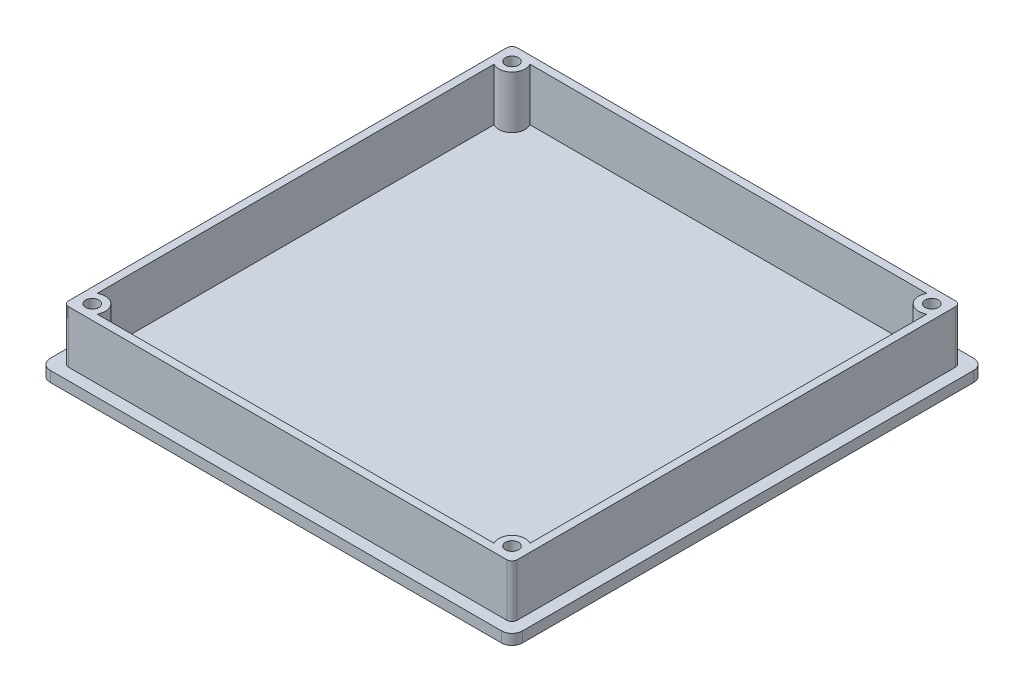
ISO-10303-21;
HEADER;
FILE_DESCRIPTION(('STEP AP214'),'2;1');
FILE_NAME('part.step','',(''),(''),'','','');
FILE_SCHEMA(('AUTOMOTIVE_DESIGN { 1 0 10303 214 1 1 1 1 }'));
ENDSEC;
DATA;
#1=APPLICATION_CONTEXT('core data for automotive mechanical design processes');
#2=APPLICATION_PROTOCOL_DEFINITION('international standard','automotive_design',2000,#1);
#3=PRODUCT_CONTEXT('',#1,'mechanical');
#4=PRODUCT('Part','Part','',(#3));
#5=PRODUCT_RELATED_PRODUCT_CATEGORY('part','',(#4));
#6=PRODUCT_DEFINITION_FORMATION('','',#4);
#7=PRODUCT_DEFINITION_CONTEXT('part definition',#1,'design');
#8=PRODUCT_DEFINITION('design','',#6,#7);
#9=PRODUCT_DEFINITION_SHAPE('','',#8);
#10=(LENGTH_UNIT() NAMED_UNIT(*) SI_UNIT(.MILLI.,.METRE.));
#11=(NAMED_UNIT(*) PLANE_ANGLE_UNIT() SI_UNIT($,.RADIAN.));
#12=(NAMED_UNIT(*) SI_UNIT($,.STERADIAN.) SOLID_ANGLE_UNIT());
#13=UNCERTAINTY_MEASURE_WITH_UNIT(LENGTH_MEASURE(1.E-05),#10,'distance_accuracy_value','');
#14=(GEOMETRIC_REPRESENTATION_CONTEXT(3) GLOBAL_UNCERTAINTY_ASSIGNED_CONTEXT((#13)) GLOBAL_UNIT_ASSIGNED_CONTEXT((#10,
#11,#12)) REPRESENTATION_CONTEXT('',''));
#15=CARTESIAN_POINT('',(0.,0.,0.));
#16=DIRECTION('',(0.,0.,1.));
#17=DIRECTION('',(1.,0.,0.));
#18=AXIS2_PLACEMENT_3D('',#15,#16,#17);
#19=CARTESIAN_POINT('',(-82.5,24.,82.5));
#20=DIRECTION('',(0.,0.,-1.));
#21=DIRECTION('',(-1.,0.,0.));
#22=AXIS2_PLACEMENT_3D('',#19,#20,#21);
#23=PLANE('',#22);
#24=DIRECTION('',(1.,0.,0.));
#25=VECTOR('',#24,1.);
#26=CARTESIAN_POINT('',(-82.5,24.,82.5));
#27=LINE('',#26,#25);
#28=CARTESIAN_POINT('',(-75.6698729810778,24.,82.5));
#29=VERTEX_POINT('',#28);
#30=CARTESIAN_POINT('',(75.6698729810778,24.,82.5));
#31=VERTEX_POINT('',#30);
#32=EDGE_CURVE('E224',#29,#31,#27,.T.);
#33=ORIENTED_EDGE('',*,*,#32,.T.);
#34=DIRECTION('',(0.,-1.,0.));
#35=VECTOR('',#34,1.);
#36=CARTESIAN_POINT('',(75.6698729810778,38.142135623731,82.5));
#37=LINE('',#36,#35);
#38=CARTESIAN_POINT('',(75.6698729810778,4.,82.5));
#39=VERTEX_POINT('',#38);
#40=EDGE_CURVE('E203',#31,#39,#37,.T.);
#41=ORIENTED_EDGE('',*,*,#40,.T.);
#42=DIRECTION('',(1.,0.,0.));
#43=VECTOR('',#42,1.);
#44=CARTESIAN_POINT('',(-82.5,4.,82.5));
#45=LINE('',#44,#43);
#46=CARTESIAN_POINT('',(-75.6698729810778,4.,82.5));
#47=VERTEX_POINT('',#46);
#48=EDGE_CURVE('E239',#47,#39,#45,.T.);
#49=ORIENTED_EDGE('',*,*,#48,.F.);
#50=DIRECTION('',(0.,-1.,0.));
#51=VECTOR('',#50,1.);
#52=CARTESIAN_POINT('',(-75.6698729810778,38.142135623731,82.5));
#53=LINE('',#52,#51);
#54=EDGE_CURVE('E788',#47,#29,#53,.F.);
#55=ORIENTED_EDGE('',*,*,#54,.T.);
#56=EDGE_LOOP('',(#33,#41,#49,#55));
#57=FACE_BOUND('',#56,.T.);
#58=ADVANCED_FACE('F36',(#57),#23,.T.);
#59=CARTESIAN_POINT('',(82.5,24.,82.5));
#60=DIRECTION('',(-1.,0.,0.));
#61=DIRECTION('',(0.,0.,1.));
#62=AXIS2_PLACEMENT_3D('',#59,#60,#61);
#63=PLANE('',#62);
#64=DIRECTION('',(0.,0.,-1.));
#65=VECTOR('',#64,1.);
#66=CARTESIAN_POINT('',(82.5,4.,82.5));
#67=LINE('',#66,#65);
#68=CARTESIAN_POINT('',(82.5,4.,75.6698729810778));
#69=VERTEX_POINT('',#68);
#70=CARTESIAN_POINT('',(82.5,4.,-75.6698729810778));
#71=VERTEX_POINT('',#70);
#72=EDGE_CURVE('E216',#69,#71,#67,.T.);
#73=ORIENTED_EDGE('',*,*,#72,.F.);
#74=DIRECTION('',(0.,-1.,0.));
#75=VECTOR('',#74,1.);
#76=CARTESIAN_POINT('',(82.5,38.142135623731,75.6698729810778));
#77=LINE('',#76,#75);
#78=CARTESIAN_POINT('',(82.5,24.,75.6698729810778));
#79=VERTEX_POINT('',#78);
#80=EDGE_CURVE('E200',#69,#79,#77,.F.);
#81=ORIENTED_EDGE('',*,*,#80,.T.);
#82=DIRECTION('',(0.,0.,-1.));
#83=VECTOR('',#82,1.);
#84=CARTESIAN_POINT('',(82.5,24.,82.5));
#85=LINE('',#84,#83);
#86=CARTESIAN_POINT('',(82.5,24.,-75.6698729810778));
#87=VERTEX_POINT('',#86);
#88=EDGE_CURVE('E214',#79,#87,#85,.T.);
#89=ORIENTED_EDGE('',*,*,#88,.T.);
#90=DIRECTION('',(0.,-1.,0.));
#91=VECTOR('',#90,1.);
#92=CARTESIAN_POINT('',(82.5,38.142135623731,-75.6698729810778));
#93=LINE('',#92,#91);
#94=EDGE_CURVE('E783',#87,#71,#93,.T.);
#95=ORIENTED_EDGE('',*,*,#94,.T.);
#96=EDGE_LOOP('',(#73,#81,#89,#95));
#97=FACE_BOUND('',#96,.T.);
#98=ADVANCED_FACE('F212',(#97),#63,.T.);
#99=CARTESIAN_POINT('',(-82.5,24.,-82.5));
#100=DIRECTION('',(1.,0.,0.));
#101=DIRECTION('',(0.,0.,-1.));
#102=AXIS2_PLACEMENT_3D('',#99,#100,#101);
#103=PLANE('',#102);
#104=DIRECTION('',(0.,0.,1.));
#105=VECTOR('',#104,1.);
#106=CARTESIAN_POINT('',(-82.5,24.,-82.5));
#107=LINE('',#106,#105);
#108=CARTESIAN_POINT('',(-82.5,24.,-75.6698729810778));
#109=VERTEX_POINT('',#108);
#110=CARTESIAN_POINT('',(-82.5,24.,75.6698729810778));
#111=VERTEX_POINT('',#110);
#112=EDGE_CURVE('E229',#109,#111,#107,.T.);
#113=ORIENTED_EDGE('',*,*,#112,.T.);
#114=DIRECTION('',(0.,-1.,0.));
#115=VECTOR('',#114,1.);
#116=CARTESIAN_POINT('',(-82.5,38.142135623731,75.6698729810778));
#117=LINE('',#116,#115);
#118=CARTESIAN_POINT('',(-82.5,4.,75.6698729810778));
#119=VERTEX_POINT('',#118);
#120=EDGE_CURVE('E780',#111,#119,#117,.T.);
#121=ORIENTED_EDGE('',*,*,#120,.T.);
#122=DIRECTION('',(0.,0.,1.));
#123=VECTOR('',#122,1.);
#124=CARTESIAN_POINT('',(-82.5,4.,-82.5));
#125=LINE('',#124,#123);
#126=CARTESIAN_POINT('',(-82.5,4.,-75.6698729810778));
#127=VERTEX_POINT('',#126);
#128=EDGE_CURVE('E235',#127,#119,#125,.T.);
#129=ORIENTED_EDGE('',*,*,#128,.F.);
#130=DIRECTION('',(0.,-1.,0.));
#131=VECTOR('',#130,1.);
#132=CARTESIAN_POINT('',(-82.5,38.142135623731,-75.6698729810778));
#133=LINE('',#132,#131);
#134=EDGE_CURVE('E765',#127,#109,#133,.F.);
#135=ORIENTED_EDGE('',*,*,#134,.T.);
#136=EDGE_LOOP('',(#113,#121,#129,#135));
#137=FACE_BOUND('',#136,.T.);
#138=ADVANCED_FACE('F430',(#137),#103,.T.);
#139=CARTESIAN_POINT('',(82.5,24.,-82.5));
#140=DIRECTION('',(0.,0.,1.));
#141=DIRECTION('',(1.,0.,0.));
#142=AXIS2_PLACEMENT_3D('',#139,#140,#141);
#143=PLANE('',#142);
#144=DIRECTION('',(-1.,0.,0.));
#145=VECTOR('',#144,1.);
#146=CARTESIAN_POINT('',(82.5,4.,-82.5));
#147=LINE('',#146,#145);
#148=CARTESIAN_POINT('',(75.6698729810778,4.,-82.5));
#149=VERTEX_POINT('',#148);
#150=CARTESIAN_POINT('',(-75.6698729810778,4.,-82.5));
#151=VERTEX_POINT('',#150);
#152=EDGE_CURVE('E233',#149,#151,#147,.T.);
#153=ORIENTED_EDGE('',*,*,#152,.F.);
#154=DIRECTION('',(0.,-1.,0.));
#155=VECTOR('',#154,1.);
#156=CARTESIAN_POINT('',(75.6698729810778,38.142135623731,-82.5));
#157=LINE('',#156,#155);
#158=CARTESIAN_POINT('',(75.6698729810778,24.,-82.5));
#159=VERTEX_POINT('',#158);
#160=EDGE_CURVE('E774',#149,#159,#157,.F.);
#161=ORIENTED_EDGE('',*,*,#160,.T.);
#162=DIRECTION('',(-1.,0.,0.));
#163=VECTOR('',#162,1.);
#164=CARTESIAN_POINT('',(82.5,24.,-82.5));
#165=LINE('',#164,#163);
#166=CARTESIAN_POINT('',(-75.6698729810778,24.,-82.5));
#167=VERTEX_POINT('',#166);
#168=EDGE_CURVE('E243',#159,#167,#165,.T.);
#169=ORIENTED_EDGE('',*,*,#168,.T.);
#170=DIRECTION('',(0.,-1.,0.));
#171=VECTOR('',#170,1.);
#172=CARTESIAN_POINT('',(-75.6698729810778,38.142135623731,-82.5));
#173=LINE('',#172,#171);
#174=EDGE_CURVE('E236',#167,#151,#173,.T.);
#175=ORIENTED_EDGE('',*,*,#174,.T.);
#176=EDGE_LOOP('',(#153,#161,#169,#175));
#177=FACE_BOUND('',#176,.T.);
#178=ADVANCED_FACE('F436',(#177),#143,.T.);
#179=CARTESIAN_POINT('',(0.,4.,0.));
#180=DIRECTION('',(0.,1.,0.));
#181=DIRECTION('',(0.,0.,1.));
#182=AXIS2_PLACEMENT_3D('',#179,#180,#181);
#183=PLANE('',#182);
#184=DIRECTION('',(0.,0.,-1.));
#185=VECTOR('',#184,1.);
#186=CARTESIAN_POINT('',(90.,4.,89.9999999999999));
#187=LINE('',#186,#185);
#188=CARTESIAN_POINT('',(90.,4.,85.9999999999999));
#189=VERTEX_POINT('',#188);
#190=CARTESIAN_POINT('',(90.,4.,-86.));
#191=VERTEX_POINT('',#190);
#192=EDGE_CURVE('E270',#189,#191,#187,.T.);
#193=ORIENTED_EDGE('',*,*,#192,.T.);
#194=CARTESIAN_POINT('',(86.,4.,-86.));
#195=DIRECTION('',(0.,1.,0.));
#196=DIRECTION('',(0.,0.,1.));
#197=AXIS2_PLACEMENT_3D('',#194,#195,#196);
#198=CIRCLE('',#197,4.);
#199=CARTESIAN_POINT('',(86.,4.,-90.));
#200=VERTEX_POINT('',#199);
#201=EDGE_CURVE('E379',#191,#200,#198,.T.);
#202=ORIENTED_EDGE('',*,*,#201,.T.);
#203=DIRECTION('',(-1.,0.,0.));
#204=VECTOR('',#203,1.);
#205=CARTESIAN_POINT('',(90.,4.,-90.));
#206=LINE('',#205,#204);
#207=CARTESIAN_POINT('',(-86.,4.,-90.));
#208=VERTEX_POINT('',#207);
#209=EDGE_CURVE('E273',#200,#208,#206,.T.);
#210=ORIENTED_EDGE('',*,*,#209,.T.);
#211=CARTESIAN_POINT('',(-86.,4.,-86.));
#212=DIRECTION('',(0.,1.,0.));
#213=DIRECTION('',(0.,0.,1.));
#214=AXIS2_PLACEMENT_3D('',#211,#212,#213);
#215=CIRCLE('',#214,4.);
#216=CARTESIAN_POINT('',(-90.,4.,-86.));
#217=VERTEX_POINT('',#216);
#218=EDGE_CURVE('E374',#208,#217,#215,.T.);
#219=ORIENTED_EDGE('',*,*,#218,.T.);
#220=DIRECTION('',(0.,0.,1.));
#221=VECTOR('',#220,1.);
#222=CARTESIAN_POINT('',(-90.,4.,90.));
#223=LINE('',#222,#221);
#224=CARTESIAN_POINT('',(-90.,4.,86.));
#225=VERTEX_POINT('',#224);
#226=EDGE_CURVE('E265',#217,#225,#223,.T.);
#227=ORIENTED_EDGE('',*,*,#226,.T.);
#228=CARTESIAN_POINT('',(-86.,4.,86.));
#229=DIRECTION('',(0.,1.,0.));
#230=DIRECTION('',(0.,0.,1.));
#231=AXIS2_PLACEMENT_3D('',#228,#229,#230);
#232=CIRCLE('',#231,4.);
#233=CARTESIAN_POINT('',(-86.,4.,90.));
#234=VERTEX_POINT('',#233);
#235=EDGE_CURVE('E58',#225,#234,#232,.T.);
#236=ORIENTED_EDGE('',*,*,#235,.T.);
#237=DIRECTION('',(1.,0.,0.));
#238=VECTOR('',#237,1.);
#239=CARTESIAN_POINT('',(90.,4.,89.9999999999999));
#240=LINE('',#239,#238);
#241=CARTESIAN_POINT('',(86.,4.,89.9999999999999));
#242=VERTEX_POINT('',#241);
#243=EDGE_CURVE('E267',#234,#242,#240,.T.);
#244=ORIENTED_EDGE('',*,*,#243,.T.);
#245=CARTESIAN_POINT('',(86.,4.,85.9999999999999));
#246=DIRECTION('',(0.,1.,0.));
#247=DIRECTION('',(0.,0.,1.));
#248=AXIS2_PLACEMENT_3D('',#245,#246,#247);
#249=CIRCLE('',#248,4.);
#250=EDGE_CURVE('E377',#242,#189,#249,.T.);
#251=ORIENTED_EDGE('',*,*,#250,.T.);
#252=EDGE_LOOP('',(#193,#202,#210,#219,#227,#236,#244,#251));
#253=FACE_BOUND('',#252,.T.);
#254=DIRECTION('',(0.,0.,1.));
#255=VECTOR('',#254,1.);
#256=CARTESIAN_POINT('',(-85.5,4.,-85.5));
#257=LINE('',#256,#255);
#258=CARTESIAN_POINT('',(-85.5,4.,-83.5));
#259=VERTEX_POINT('',#258);
#260=CARTESIAN_POINT('',(-85.5,4.,83.4999999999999));
#261=VERTEX_POINT('',#260);
#262=EDGE_CURVE('E227',#259,#261,#257,.T.);
#263=ORIENTED_EDGE('',*,*,#262,.F.);
#264=CARTESIAN_POINT('',(-83.5,4.,-83.5));
#265=DIRECTION('',(0.,1.,0.));
#266=DIRECTION('',(0.,0.,1.));
#267=AXIS2_PLACEMENT_3D('',#264,#265,#266);
#268=CIRCLE('',#267,2.);
#269=CARTESIAN_POINT('',(-83.4999999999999,4.,-85.5));
#270=VERTEX_POINT('',#269);
#271=EDGE_CURVE('E348',#259,#270,#268,.F.);
#272=ORIENTED_EDGE('',*,*,#271,.T.);
#273=DIRECTION('',(-1.,0.,0.));
#274=VECTOR('',#273,1.);
#275=CARTESIAN_POINT('',(85.5,4.,-85.5));
#276=LINE('',#275,#274);
#277=CARTESIAN_POINT('',(83.5,4.,-85.5));
#278=VERTEX_POINT('',#277);
#279=EDGE_CURVE('E223',#278,#270,#276,.T.);
#280=ORIENTED_EDGE('',*,*,#279,.F.);
#281=CARTESIAN_POINT('',(83.5,4.,-83.5));
#282=DIRECTION('',(0.,1.,0.));
#283=DIRECTION('',(0.,0.,1.));
#284=AXIS2_PLACEMENT_3D('',#281,#282,#283);
#285=CIRCLE('',#284,2.);
#286=CARTESIAN_POINT('',(85.5,4.,-83.5));
#287=VERTEX_POINT('',#286);
#288=EDGE_CURVE('E350',#278,#287,#285,.F.);
#289=ORIENTED_EDGE('',*,*,#288,.T.);
#290=DIRECTION('',(0.,0.,-1.));
#291=VECTOR('',#290,1.);
#292=CARTESIAN_POINT('',(85.5,4.,85.4999999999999));
#293=LINE('',#292,#291);
#294=CARTESIAN_POINT('',(85.5,4.,83.4999999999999));
#295=VERTEX_POINT('',#294);
#296=EDGE_CURVE('E248',#295,#287,#293,.T.);
#297=ORIENTED_EDGE('',*,*,#296,.F.);
#298=CARTESIAN_POINT('',(83.5,4.,83.4999999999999));
#299=DIRECTION('',(0.,1.,0.));
#300=DIRECTION('',(0.,0.,1.));
#301=AXIS2_PLACEMENT_3D('',#298,#299,#300);
#302=CIRCLE('',#301,2.);
#303=CARTESIAN_POINT('',(83.4999999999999,4.,85.4999999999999));
#304=VERTEX_POINT('',#303);
#305=EDGE_CURVE('E352',#295,#304,#302,.F.);
#306=ORIENTED_EDGE('',*,*,#305,.T.);
#307=DIRECTION('',(1.,0.,0.));
#308=VECTOR('',#307,1.);
#309=CARTESIAN_POINT('',(-85.5,4.,85.5));
#310=LINE('',#309,#308);
#311=CARTESIAN_POINT('',(-83.5,4.,85.5));
#312=VERTEX_POINT('',#311);
#313=EDGE_CURVE('E260',#312,#304,#310,.T.);
#314=ORIENTED_EDGE('',*,*,#313,.F.);
#315=CARTESIAN_POINT('',(-83.5,4.,83.5));
#316=DIRECTION('',(0.,1.,0.));
#317=DIRECTION('',(0.,0.,1.));
#318=AXIS2_PLACEMENT_3D('',#315,#316,#317);
#319=CIRCLE('',#318,2.);
#320=EDGE_CURVE('E354',#312,#261,#319,.F.);
#321=ORIENTED_EDGE('',*,*,#320,.T.);
#322=EDGE_LOOP('',(#263,#272,#280,#289,#297,#306,#314,#321));
#323=FACE_BOUND('',#322,.T.);
#324=ADVANCED_FACE('F402',(#253,#323),#183,.T.);
#325=CARTESIAN_POINT('',(-90.,4.,90.));
#326=DIRECTION('',(1.,0.,0.));
#327=DIRECTION('',(0.,0.,-1.));
#328=AXIS2_PLACEMENT_3D('',#325,#326,#327);
#329=PLANE('',#328);
#330=DIRECTION('',(0.,0.,1.));
#331=VECTOR('',#330,1.);
#332=CARTESIAN_POINT('',(-90.,0.,90.));
#333=LINE('',#332,#331);
#334=CARTESIAN_POINT('',(-90.,0.,-86.));
#335=VERTEX_POINT('',#334);
#336=CARTESIAN_POINT('',(-90.,0.,86.));
#337=VERTEX_POINT('',#336);
#338=EDGE_CURVE('E256',#335,#337,#333,.T.);
#339=ORIENTED_EDGE('',*,*,#338,.T.);
#340=DIRECTION('',(0.,-1.,0.));
#341=VECTOR('',#340,1.);
#342=CARTESIAN_POINT('',(-90.,4.,86.));
#343=LINE('',#342,#341);
#344=EDGE_CURVE('E11',#337,#225,#343,.F.);
#345=ORIENTED_EDGE('',*,*,#344,.T.);
#346=ORIENTED_EDGE('',*,*,#226,.F.);
#347=DIRECTION('',(0.,-1.,0.));
#348=VECTOR('',#347,1.);
#349=CARTESIAN_POINT('',(-90.,4.,-86.));
#350=LINE('',#349,#348);
#351=EDGE_CURVE('E44',#217,#335,#350,.T.);
#352=ORIENTED_EDGE('',*,*,#351,.T.);
#353=EDGE_LOOP('',(#339,#345,#346,#352));
#354=FACE_BOUND('',#353,.T.);
#355=ADVANCED_FACE('F389',(#354),#329,.F.);
#356=CARTESIAN_POINT('',(90.,4.,89.9999999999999));
#357=DIRECTION('',(0.,0.,-1.));
#358=DIRECTION('',(-1.,0.,0.));
#359=AXIS2_PLACEMENT_3D('',#356,#357,#358);
#360=PLANE('',#359);
#361=DIRECTION('',(1.,0.,0.));
#362=VECTOR('',#361,1.);
#363=CARTESIAN_POINT('',(90.,0.,89.9999999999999));
#364=LINE('',#363,#362);
#365=CARTESIAN_POINT('',(-86.,0.,90.));
#366=VERTEX_POINT('',#365);
#367=CARTESIAN_POINT('',(86.,0.,89.9999999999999));
#368=VERTEX_POINT('',#367);
#369=EDGE_CURVE('E279',#366,#368,#364,.T.);
#370=ORIENTED_EDGE('',*,*,#369,.T.);
#371=DIRECTION('',(0.,-1.,0.));
#372=VECTOR('',#371,1.);
#373=CARTESIAN_POINT('',(86.,4.,89.9999999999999));
#374=LINE('',#373,#372);
#375=EDGE_CURVE('E51',#368,#242,#374,.F.);
#376=ORIENTED_EDGE('',*,*,#375,.T.);
#377=ORIENTED_EDGE('',*,*,#243,.F.);
#378=DIRECTION('',(0.,-1.,0.));
#379=VECTOR('',#378,1.);
#380=CARTESIAN_POINT('',(-86.,4.,90.));
#381=LINE('',#380,#379);
#382=EDGE_CURVE('E381',#234,#366,#381,.T.);
#383=ORIENTED_EDGE('',*,*,#382,.T.);
#384=EDGE_LOOP('',(#370,#376,#377,#383));
#385=FACE_BOUND('',#384,.T.);
#386=ADVANCED_FACE('F400',(#385),#360,.F.);
#387=CARTESIAN_POINT('',(90.,4.,89.9999999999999));
#388=DIRECTION('',(-1.,0.,0.));
#389=DIRECTION('',(0.,0.,1.));
#390=AXIS2_PLACEMENT_3D('',#387,#388,#389);
#391=PLANE('',#390);
#392=DIRECTION('',(0.,0.,-1.));
#393=VECTOR('',#392,1.);
#394=CARTESIAN_POINT('',(90.,0.,89.9999999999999));
#395=LINE('',#394,#393);
#396=CARTESIAN_POINT('',(90.,0.,85.9999999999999));
#397=VERTEX_POINT('',#396);
#398=CARTESIAN_POINT('',(90.,0.,-86.));
#399=VERTEX_POINT('',#398);
#400=EDGE_CURVE('E281',#397,#399,#395,.T.);
#401=ORIENTED_EDGE('',*,*,#400,.T.);
#402=DIRECTION('',(0.,-1.,0.));
#403=VECTOR('',#402,1.);
#404=CARTESIAN_POINT('',(90.,4.,-86.));
#405=LINE('',#404,#403);
#406=EDGE_CURVE('E372',#399,#191,#405,.F.);
#407=ORIENTED_EDGE('',*,*,#406,.T.);
#408=ORIENTED_EDGE('',*,*,#192,.F.);
#409=DIRECTION('',(0.,-1.,0.));
#410=VECTOR('',#409,1.);
#411=CARTESIAN_POINT('',(90.,4.,85.9999999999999));
#412=LINE('',#411,#410);
#413=EDGE_CURVE('E369',#189,#397,#412,.T.);
#414=ORIENTED_EDGE('',*,*,#413,.T.);
#415=EDGE_LOOP('',(#401,#407,#408,#414));
#416=FACE_BOUND('',#415,.T.);
#417=ADVANCED_FACE('F410',(#416),#391,.F.);
#418=CARTESIAN_POINT('',(90.,4.,-90.));
#419=DIRECTION('',(0.,0.,1.));
#420=DIRECTION('',(1.,0.,0.));
#421=AXIS2_PLACEMENT_3D('',#418,#419,#420);
#422=PLANE('',#421);
#423=ORIENTED_EDGE('',*,*,#209,.F.);
#424=DIRECTION('',(0.,-1.,0.));
#425=VECTOR('',#424,1.);
#426=CARTESIAN_POINT('',(86.,4.,-90.));
#427=LINE('',#426,#425);
#428=CARTESIAN_POINT('',(86.,0.,-90.));
#429=VERTEX_POINT('',#428);
#430=EDGE_CURVE('E358',#200,#429,#427,.T.);
#431=ORIENTED_EDGE('',*,*,#430,.T.);
#432=DIRECTION('',(-1.,0.,0.));
#433=VECTOR('',#432,1.);
#434=CARTESIAN_POINT('',(90.,0.,-90.));
#435=LINE('',#434,#433);
#436=CARTESIAN_POINT('',(-86.,0.,-90.));
#437=VERTEX_POINT('',#436);
#438=EDGE_CURVE('E268',#429,#437,#435,.T.);
#439=ORIENTED_EDGE('',*,*,#438,.T.);
#440=DIRECTION('',(0.,-1.,0.));
#441=VECTOR('',#440,1.);
#442=CARTESIAN_POINT('',(-86.,4.,-90.));
#443=LINE('',#442,#441);
#444=EDGE_CURVE('E356',#437,#208,#443,.F.);
#445=ORIENTED_EDGE('',*,*,#444,.T.);
#446=EDGE_LOOP('',(#423,#431,#439,#445));
#447=FACE_BOUND('',#446,.T.);
#448=ADVANCED_FACE('F418',(#447),#422,.F.);
#449=CARTESIAN_POINT('',(0.,0.,0.));
#450=DIRECTION('',(0.,1.,0.));
#451=DIRECTION('',(0.,0.,1.));
#452=AXIS2_PLACEMENT_3D('',#449,#450,#451);
#453=PLANE('',#452);
#454=CARTESIAN_POINT('',(80.,0.,80.));
#455=DIRECTION('',(0.,1.,0.));
#456=DIRECTION('',(0.,0.,1.));
#457=AXIS2_PLACEMENT_3D('',#454,#455,#456);
#458=CIRCLE('',#457,5.99999999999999);
#459=CARTESIAN_POINT('',(80.,0.,86.));
#460=VERTEX_POINT('',#459);
#461=EDGE_CURVE('E314',#460,#460,#458,.T.);
#462=ORIENTED_EDGE('',*,*,#461,.T.);
#463=EDGE_LOOP('',(#462));
#464=FACE_BOUND('',#463,.T.);
#465=CARTESIAN_POINT('',(-80.,0.,80.));
#466=DIRECTION('',(0.,1.,0.));
#467=DIRECTION('',(0.,0.,1.));
#468=AXIS2_PLACEMENT_3D('',#465,#466,#467);
#469=CIRCLE('',#468,5.99999999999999);
#470=CARTESIAN_POINT('',(-80.,0.,86.));
#471=VERTEX_POINT('',#470);
#472=EDGE_CURVE('E308',#471,#471,#469,.T.);
#473=ORIENTED_EDGE('',*,*,#472,.T.);
#474=EDGE_LOOP('',(#473));
#475=FACE_BOUND('',#474,.T.);
#476=CARTESIAN_POINT('',(80.,0.,-80.));
#477=DIRECTION('',(0.,1.,0.));
#478=DIRECTION('',(0.,0.,1.));
#479=AXIS2_PLACEMENT_3D('',#476,#477,#478);
#480=CIRCLE('',#479,5.99999999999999);
#481=CARTESIAN_POINT('',(80.,0.,-74.));
#482=VERTEX_POINT('',#481);
#483=EDGE_CURVE('E302',#482,#482,#480,.T.);
#484=ORIENTED_EDGE('',*,*,#483,.T.);
#485=EDGE_LOOP('',(#484));
#486=FACE_BOUND('',#485,.T.);
#487=CARTESIAN_POINT('',(-80.,0.,-80.));
#488=DIRECTION('',(0.,1.,0.));
#489=DIRECTION('',(0.,0.,1.));
#490=AXIS2_PLACEMENT_3D('',#487,#488,#489);
#491=CIRCLE('',#490,5.99999999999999);
#492=CARTESIAN_POINT('',(-80.,0.,-74.));
#493=VERTEX_POINT('',#492);
#494=EDGE_CURVE('E288',#493,#493,#491,.T.);
#495=ORIENTED_EDGE('',*,*,#494,.T.);
#496=EDGE_LOOP('',(#495));
#497=FACE_BOUND('',#496,.T.);
#498=ORIENTED_EDGE('',*,*,#438,.F.);
#499=CARTESIAN_POINT('',(86.,0.,-86.));
#500=DIRECTION('',(0.,1.,0.));
#501=DIRECTION('',(0.,0.,1.));
#502=AXIS2_PLACEMENT_3D('',#499,#500,#501);
#503=CIRCLE('',#502,4.);
#504=EDGE_CURVE('E367',#429,#399,#503,.F.);
#505=ORIENTED_EDGE('',*,*,#504,.T.);
#506=ORIENTED_EDGE('',*,*,#400,.F.);
#507=CARTESIAN_POINT('',(86.,0.,85.9999999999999));
#508=DIRECTION('',(0.,1.,0.));
#509=DIRECTION('',(0.,0.,1.));
#510=AXIS2_PLACEMENT_3D('',#507,#508,#509);
#511=CIRCLE('',#510,4.);
#512=EDGE_CURVE('E365',#397,#368,#511,.F.);
#513=ORIENTED_EDGE('',*,*,#512,.T.);
#514=ORIENTED_EDGE('',*,*,#369,.F.);
#515=CARTESIAN_POINT('',(-86.,0.,86.));
#516=DIRECTION('',(0.,1.,0.));
#517=DIRECTION('',(0.,0.,1.));
#518=AXIS2_PLACEMENT_3D('',#515,#516,#517);
#519=CIRCLE('',#518,4.);
#520=EDGE_CURVE('E363',#366,#337,#519,.F.);
#521=ORIENTED_EDGE('',*,*,#520,.T.);
#522=ORIENTED_EDGE('',*,*,#338,.F.);
#523=CARTESIAN_POINT('',(-86.,0.,-86.));
#524=DIRECTION('',(0.,1.,0.));
#525=DIRECTION('',(0.,0.,1.));
#526=AXIS2_PLACEMENT_3D('',#523,#524,#525);
#527=CIRCLE('',#526,4.);
#528=EDGE_CURVE('E361',#335,#437,#527,.F.);
#529=ORIENTED_EDGE('',*,*,#528,.T.);
#530=EDGE_LOOP('',(#498,#505,#506,#513,#514,#521,#522,#529));
#531=FACE_BOUND('',#530,.T.);
#532=ADVANCED_FACE('F395',(#464,#475,#486,#497,#531),#453,.F.);
#533=CARTESIAN_POINT('',(0.,24.,0.));
#534=DIRECTION('',(0.,1.,0.));
#535=DIRECTION('',(0.,0.,1.));
#536=AXIS2_PLACEMENT_3D('',#533,#534,#535);
#537=PLANE('',#536);
#538=CARTESIAN_POINT('',(80.,24.,-80.));
#539=DIRECTION('',(0.,1.,0.));
#540=DIRECTION('',(0.,0.,1.));
#541=AXIS2_PLACEMENT_3D('',#538,#539,#540);
#542=CIRCLE('',#541,2.5);
#543=CARTESIAN_POINT('',(80.,24.,-77.5));
#544=VERTEX_POINT('',#543);
#545=EDGE_CURVE('E208',#544,#544,#542,.T.);
#546=ORIENTED_EDGE('',*,*,#545,.F.);
#547=EDGE_LOOP('',(#546));
#548=FACE_BOUND('',#547,.T.);
#549=CARTESIAN_POINT('',(-80.,24.,80.));
#550=DIRECTION('',(0.,1.,0.));
#551=DIRECTION('',(0.,0.,1.));
#552=AXIS2_PLACEMENT_3D('',#549,#550,#551);
#553=CIRCLE('',#552,2.5);
#554=CARTESIAN_POINT('',(-80.,24.,82.5));
#555=VERTEX_POINT('',#554);
#556=EDGE_CURVE('E797',#555,#555,#553,.T.);
#557=ORIENTED_EDGE('',*,*,#556,.F.);
#558=EDGE_LOOP('',(#557));
#559=FACE_BOUND('',#558,.T.);
#560=CARTESIAN_POINT('',(80.,24.,80.));
#561=DIRECTION('',(0.,1.,0.));
#562=DIRECTION('',(0.,0.,1.));
#563=AXIS2_PLACEMENT_3D('',#560,#561,#562);
#564=CIRCLE('',#563,2.5);
#565=CARTESIAN_POINT('',(80.,24.,82.5));
#566=VERTEX_POINT('',#565);
#567=EDGE_CURVE('E794',#566,#566,#564,.T.);
#568=ORIENTED_EDGE('',*,*,#567,.F.);
#569=EDGE_LOOP('',(#568));
#570=FACE_BOUND('',#569,.T.);
#571=ORIENTED_EDGE('',*,*,#88,.F.);
#572=CARTESIAN_POINT('',(80.,24.,80.));
#573=DIRECTION('',(0.,1.,0.));
#574=DIRECTION('',(0.,0.,1.));
#575=AXIS2_PLACEMENT_3D('',#572,#573,#574);
#576=CIRCLE('',#575,5.00000000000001);
#577=EDGE_CURVE('E197',#79,#31,#576,.T.);
#578=ORIENTED_EDGE('',*,*,#577,.T.);
#579=ORIENTED_EDGE('',*,*,#32,.F.);
#580=CARTESIAN_POINT('',(-80.,24.,80.));
#581=DIRECTION('',(0.,1.,0.));
#582=DIRECTION('',(0.,0.,1.));
#583=AXIS2_PLACEMENT_3D('',#580,#581,#582);
#584=CIRCLE('',#583,5.00000000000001);
#585=EDGE_CURVE('E791',#29,#111,#584,.T.);
#586=ORIENTED_EDGE('',*,*,#585,.T.);
#587=ORIENTED_EDGE('',*,*,#112,.F.);
#588=CARTESIAN_POINT('',(-80.,24.,-80.));
#589=DIRECTION('',(0.,1.,0.));
#590=DIRECTION('',(0.,0.,1.));
#591=AXIS2_PLACEMENT_3D('',#588,#589,#590);
#592=CIRCLE('',#591,5.00000000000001);
#593=EDGE_CURVE('E762',#109,#167,#592,.T.);
#594=ORIENTED_EDGE('',*,*,#593,.T.);
#595=ORIENTED_EDGE('',*,*,#168,.F.);
#596=CARTESIAN_POINT('',(80.,24.,-80.));
#597=DIRECTION('',(0.,1.,0.));
#598=DIRECTION('',(0.,0.,1.));
#599=AXIS2_PLACEMENT_3D('',#596,#597,#598);
#600=CIRCLE('',#599,5.00000000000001);
#601=EDGE_CURVE('E222',#159,#87,#600,.T.);
#602=ORIENTED_EDGE('',*,*,#601,.T.);
#603=EDGE_LOOP('',(#571,#578,#579,#586,#587,#594,#595,#602));
#604=FACE_BOUND('',#603,.T.);
#605=CARTESIAN_POINT('',(-80.,24.,-80.));
#606=DIRECTION('',(0.,1.,0.));
#607=DIRECTION('',(0.,0.,1.));
#608=AXIS2_PLACEMENT_3D('',#605,#606,#607);
#609=CIRCLE('',#608,2.5);
#610=CARTESIAN_POINT('',(-80.,24.,-77.5));
#611=VERTEX_POINT('',#610);
#612=EDGE_CURVE('E770',#611,#611,#609,.T.);
#613=ORIENTED_EDGE('',*,*,#612,.F.);
#614=EDGE_LOOP('',(#613));
#615=FACE_BOUND('',#614,.T.);
#616=DIRECTION('',(-1.,0.,0.));
#617=VECTOR('',#616,1.);
#618=CARTESIAN_POINT('',(85.5,24.,-85.5));
#619=LINE('',#618,#617);
#620=CARTESIAN_POINT('',(83.5,24.,-85.5));
#621=VERTEX_POINT('',#620);
#622=CARTESIAN_POINT('',(-83.4999999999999,24.,-85.5));
#623=VERTEX_POINT('',#622);
#624=EDGE_CURVE('E244',#621,#623,#619,.T.);
#625=ORIENTED_EDGE('',*,*,#624,.T.);
#626=CARTESIAN_POINT('',(-83.5,24.,-83.5));
#627=DIRECTION('',(0.,1.,0.));
#628=DIRECTION('',(0.,0.,1.));
#629=AXIS2_PLACEMENT_3D('',#626,#627,#628);
#630=CIRCLE('',#629,2.);
#631=CARTESIAN_POINT('',(-85.5,24.,-83.5));
#632=VERTEX_POINT('',#631);
#633=EDGE_CURVE('E336',#623,#632,#630,.T.);
#634=ORIENTED_EDGE('',*,*,#633,.T.);
#635=DIRECTION('',(0.,0.,1.));
#636=VECTOR('',#635,1.);
#637=CARTESIAN_POINT('',(-85.5,24.,-85.5));
#638=LINE('',#637,#636);
#639=CARTESIAN_POINT('',(-85.5,24.,83.4999999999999));
#640=VERTEX_POINT('',#639);
#641=EDGE_CURVE('E247',#632,#640,#638,.T.);
#642=ORIENTED_EDGE('',*,*,#641,.T.);
#643=CARTESIAN_POINT('',(-83.5,24.,83.5));
#644=DIRECTION('',(0.,1.,0.));
#645=DIRECTION('',(0.,0.,1.));
#646=AXIS2_PLACEMENT_3D('',#643,#644,#645);
#647=CIRCLE('',#646,2.);
#648=CARTESIAN_POINT('',(-83.5,24.,85.5));
#649=VERTEX_POINT('',#648);
#650=EDGE_CURVE('E330',#640,#649,#647,.T.);
#651=ORIENTED_EDGE('',*,*,#650,.T.);
#652=DIRECTION('',(1.,0.,0.));
#653=VECTOR('',#652,1.);
#654=CARTESIAN_POINT('',(-85.5,24.,85.5));
#655=LINE('',#654,#653);
#656=CARTESIAN_POINT('',(83.4999999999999,24.,85.4999999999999));
#657=VERTEX_POINT('',#656);
#658=EDGE_CURVE('E251',#649,#657,#655,.T.);
#659=ORIENTED_EDGE('',*,*,#658,.T.);
#660=CARTESIAN_POINT('',(83.5,24.,83.4999999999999));
#661=DIRECTION('',(0.,1.,0.));
#662=DIRECTION('',(0.,0.,1.));
#663=AXIS2_PLACEMENT_3D('',#660,#661,#662);
#664=CIRCLE('',#663,2.);
#665=CARTESIAN_POINT('',(85.5,24.,83.4999999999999));
#666=VERTEX_POINT('',#665);
#667=EDGE_CURVE('E332',#657,#666,#664,.T.);
#668=ORIENTED_EDGE('',*,*,#667,.T.);
#669=DIRECTION('',(0.,0.,-1.));
#670=VECTOR('',#669,1.);
#671=CARTESIAN_POINT('',(85.5,24.,85.4999999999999));
#672=LINE('',#671,#670);
#673=CARTESIAN_POINT('',(85.5,24.,-83.5));
#674=VERTEX_POINT('',#673);
#675=EDGE_CURVE('E254',#666,#674,#672,.T.);
#676=ORIENTED_EDGE('',*,*,#675,.T.);
#677=CARTESIAN_POINT('',(83.5,24.,-83.5));
#678=DIRECTION('',(0.,1.,0.));
#679=DIRECTION('',(0.,0.,1.));
#680=AXIS2_PLACEMENT_3D('',#677,#678,#679);
#681=CIRCLE('',#680,2.);
#682=EDGE_CURVE('E334',#674,#621,#681,.T.);
#683=ORIENTED_EDGE('',*,*,#682,.T.);
#684=EDGE_LOOP('',(#625,#634,#642,#651,#659,#668,#676,#683));
#685=FACE_BOUND('',#684,.T.);
#686=ADVANCED_FACE('F219',(#548,#559,#570,#604,#615,#685),#537,.T.);
#687=CARTESIAN_POINT('',(85.5,24.,-85.5));
#688=DIRECTION('',(0.,0.,1.));
#689=DIRECTION('',(1.,0.,0.));
#690=AXIS2_PLACEMENT_3D('',#687,#688,#689);
#691=PLANE('',#690);
#692=ORIENTED_EDGE('',*,*,#279,.T.);
#693=DIRECTION('',(0.,-1.,0.));
#694=VECTOR('',#693,1.);
#695=CARTESIAN_POINT('',(-83.5,24.,-85.5));
#696=LINE('',#695,#694);
#697=EDGE_CURVE('E328',#270,#623,#696,.F.);
#698=ORIENTED_EDGE('',*,*,#697,.T.);
#699=ORIENTED_EDGE('',*,*,#624,.F.);
#700=DIRECTION('',(0.,-1.,0.));
#701=VECTOR('',#700,1.);
#702=CARTESIAN_POINT('',(83.5,24.,-85.5));
#703=LINE('',#702,#701);
#704=EDGE_CURVE('E325',#621,#278,#703,.T.);
#705=ORIENTED_EDGE('',*,*,#704,.T.);
#706=EDGE_LOOP('',(#692,#698,#699,#705));
#707=FACE_BOUND('',#706,.T.);
#708=ADVANCED_FACE('F443',(#707),#691,.F.);
#709=CARTESIAN_POINT('',(-85.5,24.,-85.5));
#710=DIRECTION('',(1.,0.,0.));
#711=DIRECTION('',(0.,0.,-1.));
#712=AXIS2_PLACEMENT_3D('',#709,#710,#711);
#713=PLANE('',#712);
#714=ORIENTED_EDGE('',*,*,#641,.F.);
#715=DIRECTION('',(0.,-1.,0.));
#716=VECTOR('',#715,1.);
#717=CARTESIAN_POINT('',(-85.5,24.,-83.5));
#718=LINE('',#717,#716);
#719=EDGE_CURVE('E322',#632,#259,#718,.T.);
#720=ORIENTED_EDGE('',*,*,#719,.T.);
#721=ORIENTED_EDGE('',*,*,#262,.T.);
#722=DIRECTION('',(0.,-1.,0.));
#723=VECTOR('',#722,1.);
#724=CARTESIAN_POINT('',(-85.5,24.,83.5));
#725=LINE('',#724,#723);
#726=EDGE_CURVE('E320',#261,#640,#725,.F.);
#727=ORIENTED_EDGE('',*,*,#726,.T.);
#728=EDGE_LOOP('',(#714,#720,#721,#727));
#729=FACE_BOUND('',#728,.T.);
#730=ADVANCED_FACE('F453',(#729),#713,.F.);
#731=CARTESIAN_POINT('',(-85.5,24.,85.5));
#732=DIRECTION('',(0.,0.,-1.));
#733=DIRECTION('',(-1.,0.,0.));
#734=AXIS2_PLACEMENT_3D('',#731,#732,#733);
#735=PLANE('',#734);
#736=ORIENTED_EDGE('',*,*,#313,.T.);
#737=DIRECTION('',(0.,-1.,0.));
#738=VECTOR('',#737,1.);
#739=CARTESIAN_POINT('',(83.5,24.,85.4999999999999));
#740=LINE('',#739,#738);
#741=EDGE_CURVE('E346',#304,#657,#740,.F.);
#742=ORIENTED_EDGE('',*,*,#741,.T.);
#743=ORIENTED_EDGE('',*,*,#658,.F.);
#744=DIRECTION('',(0.,-1.,0.));
#745=VECTOR('',#744,1.);
#746=CARTESIAN_POINT('',(-83.5,24.,85.5));
#747=LINE('',#746,#745);
#748=EDGE_CURVE('E343',#649,#312,#747,.T.);
#749=ORIENTED_EDGE('',*,*,#748,.T.);
#750=EDGE_LOOP('',(#736,#742,#743,#749));
#751=FACE_BOUND('',#750,.T.);
#752=ADVANCED_FACE('F449',(#751),#735,.F.);
#753=CARTESIAN_POINT('',(85.5,24.,85.4999999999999));
#754=DIRECTION('',(-1.,0.,0.));
#755=DIRECTION('',(0.,0.,1.));
#756=AXIS2_PLACEMENT_3D('',#753,#754,#755);
#757=PLANE('',#756);
#758=ORIENTED_EDGE('',*,*,#296,.T.);
#759=DIRECTION('',(0.,-1.,0.));
#760=VECTOR('',#759,1.);
#761=CARTESIAN_POINT('',(85.5,24.,-83.5));
#762=LINE('',#761,#760);
#763=EDGE_CURVE('E341',#287,#674,#762,.F.);
#764=ORIENTED_EDGE('',*,*,#763,.T.);
#765=ORIENTED_EDGE('',*,*,#675,.F.);
#766=DIRECTION('',(0.,-1.,0.));
#767=VECTOR('',#766,1.);
#768=CARTESIAN_POINT('',(85.5,24.,83.4999999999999));
#769=LINE('',#768,#767);
#770=EDGE_CURVE('E338',#666,#295,#769,.T.);
#771=ORIENTED_EDGE('',*,*,#770,.T.);
#772=EDGE_LOOP('',(#758,#764,#765,#771));
#773=FACE_BOUND('',#772,.T.);
#774=ADVANCED_FACE('F445',(#773),#757,.F.);
#775=ORIENTED_EDGE('',*,*,#48,.T.);
#776=CARTESIAN_POINT('',(80.,4.,80.));
#777=DIRECTION('',(0.,1.,0.));
#778=DIRECTION('',(0.,0.,1.));
#779=AXIS2_PLACEMENT_3D('',#776,#777,#778);
#780=CIRCLE('',#779,5.00000000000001);
#781=EDGE_CURVE('E300',#39,#69,#780,.F.);
#782=ORIENTED_EDGE('',*,*,#781,.T.);
#783=ORIENTED_EDGE('',*,*,#72,.T.);
#784=CARTESIAN_POINT('',(80.,4.,-80.));
#785=DIRECTION('',(0.,1.,0.));
#786=DIRECTION('',(0.,0.,1.));
#787=AXIS2_PLACEMENT_3D('',#784,#785,#786);
#788=CIRCLE('',#787,5.00000000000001);
#789=EDGE_CURVE('E294',#71,#149,#788,.F.);
#790=ORIENTED_EDGE('',*,*,#789,.T.);
#791=ORIENTED_EDGE('',*,*,#152,.T.);
#792=CARTESIAN_POINT('',(-80.,4.,-80.));
#793=DIRECTION('',(0.,1.,0.));
#794=DIRECTION('',(0.,0.,1.));
#795=AXIS2_PLACEMENT_3D('',#792,#793,#794);
#796=CIRCLE('',#795,5.00000000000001);
#797=EDGE_CURVE('E276',#151,#127,#796,.F.);
#798=ORIENTED_EDGE('',*,*,#797,.T.);
#799=ORIENTED_EDGE('',*,*,#128,.T.);
#800=CARTESIAN_POINT('',(-80.,4.,80.));
#801=DIRECTION('',(0.,1.,0.));
#802=DIRECTION('',(0.,0.,1.));
#803=AXIS2_PLACEMENT_3D('',#800,#801,#802);
#804=CIRCLE('',#803,5.00000000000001);
#805=EDGE_CURVE('E297',#119,#47,#804,.F.);
#806=ORIENTED_EDGE('',*,*,#805,.T.);
#807=EDGE_LOOP('',(#775,#782,#783,#790,#791,#798,#799,#806));
#808=FACE_BOUND('',#807,.T.);
#809=ADVANCED_FACE('F448',(#808),#183,.T.);
#810=CARTESIAN_POINT('',(-80.,38.142135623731,-80.));
#811=DIRECTION('',(0.,-1.,0.));
#812=DIRECTION('',(0.,0.,-1.));
#813=AXIS2_PLACEMENT_3D('',#810,#811,#812);
#814=CYLINDRICAL_SURFACE('',#813,5.00000000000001);
#815=ORIENTED_EDGE('',*,*,#174,.F.);
#816=ORIENTED_EDGE('',*,*,#593,.F.);
#817=ORIENTED_EDGE('',*,*,#134,.F.);
#818=ORIENTED_EDGE('',*,*,#797,.F.);
#819=EDGE_LOOP('',(#815,#816,#817,#818));
#820=FACE_BOUND('',#819,.T.);
#821=ADVANCED_FACE('F463',(#820),#814,.T.);
#822=CARTESIAN_POINT('',(-80.,24.,-80.));
#823=DIRECTION('',(0.,-1.,0.));
#824=DIRECTION('',(0.,0.,-1.));
#825=AXIS2_PLACEMENT_3D('',#822,#823,#824);
#826=CYLINDRICAL_SURFACE('',#825,2.5);
#827=CARTESIAN_POINT('',(-80.,3.50000000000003,-80.));
#828=DIRECTION('',(0.,1.,0.));
#829=DIRECTION('',(0.,0.,1.));
#830=AXIS2_PLACEMENT_3D('',#827,#828,#829);
#831=CIRCLE('',#830,2.5);
#832=CARTESIAN_POINT('',(-80.,3.50000000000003,-77.5));
#833=VERTEX_POINT('',#832);
#834=EDGE_CURVE('E291',#833,#833,#831,.F.);
#835=ORIENTED_EDGE('',*,*,#834,.T.);
#836=EDGE_LOOP('',(#835));
#837=FACE_BOUND('',#836,.T.);
#838=ORIENTED_EDGE('',*,*,#612,.T.);
#839=EDGE_LOOP('',(#838));
#840=FACE_BOUND('',#839,.T.);
#841=ADVANCED_FACE('F480',(#837,#840),#826,.F.);
#842=CARTESIAN_POINT('',(-80.,0.,-80.));
#843=DIRECTION('',(0.,-1.,0.));
#844=DIRECTION('',(0.,0.,-1.));
#845=AXIS2_PLACEMENT_3D('',#842,#843,#844);
#846=CONICAL_SURFACE('',#845,5.99999999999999,0.785398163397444);
#847=ORIENTED_EDGE('',*,*,#834,.F.);
#848=EDGE_LOOP('',(#847));
#849=FACE_BOUND('',#848,.T.);
#850=ORIENTED_EDGE('',*,*,#494,.F.);
#851=EDGE_LOOP('',(#850));
#852=FACE_BOUND('',#851,.T.);
#853=ADVANCED_FACE('F476',(#849,#852),#846,.F.);
#854=CARTESIAN_POINT('',(80.,38.142135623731,-80.));
#855=DIRECTION('',(0.,-1.,0.));
#856=DIRECTION('',(0.,0.,-1.));
#857=AXIS2_PLACEMENT_3D('',#854,#855,#856);
#858=CYLINDRICAL_SURFACE('',#857,5.00000000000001);
#859=ORIENTED_EDGE('',*,*,#160,.F.);
#860=ORIENTED_EDGE('',*,*,#789,.F.);
#861=ORIENTED_EDGE('',*,*,#94,.F.);
#862=ORIENTED_EDGE('',*,*,#601,.F.);
#863=EDGE_LOOP('',(#859,#860,#861,#862));
#864=FACE_BOUND('',#863,.T.);
#865=ADVANCED_FACE('F479',(#864),#858,.T.);
#866=CARTESIAN_POINT('',(-80.,38.142135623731,80.));
#867=DIRECTION('',(0.,-1.,0.));
#868=DIRECTION('',(0.,0.,-1.));
#869=AXIS2_PLACEMENT_3D('',#866,#867,#868);
#870=CYLINDRICAL_SURFACE('',#869,5.00000000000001);
#871=ORIENTED_EDGE('',*,*,#120,.F.);
#872=ORIENTED_EDGE('',*,*,#585,.F.);
#873=ORIENTED_EDGE('',*,*,#54,.F.);
#874=ORIENTED_EDGE('',*,*,#805,.F.);
#875=EDGE_LOOP('',(#871,#872,#873,#874));
#876=FACE_BOUND('',#875,.T.);
#877=ADVANCED_FACE('F607',(#876),#870,.T.);
#878=CARTESIAN_POINT('',(80.,38.142135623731,80.));
#879=DIRECTION('',(0.,-1.,0.));
#880=DIRECTION('',(0.,0.,-1.));
#881=AXIS2_PLACEMENT_3D('',#878,#879,#880);
#882=CYLINDRICAL_SURFACE('',#881,5.00000000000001);
#883=ORIENTED_EDGE('',*,*,#40,.F.);
#884=ORIENTED_EDGE('',*,*,#577,.F.);
#885=ORIENTED_EDGE('',*,*,#80,.F.);
#886=ORIENTED_EDGE('',*,*,#781,.F.);
#887=EDGE_LOOP('',(#883,#884,#885,#886));
#888=FACE_BOUND('',#887,.T.);
#889=ADVANCED_FACE('F199',(#888),#882,.T.);
#890=CARTESIAN_POINT('',(80.,24.,80.));
#891=DIRECTION('',(0.,-1.,0.));
#892=DIRECTION('',(0.,0.,-1.));
#893=AXIS2_PLACEMENT_3D('',#890,#891,#892);
#894=CYLINDRICAL_SURFACE('',#893,2.5);
#895=CARTESIAN_POINT('',(80.,3.50000000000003,80.));
#896=DIRECTION('',(0.,1.,0.));
#897=DIRECTION('',(0.,0.,1.));
#898=AXIS2_PLACEMENT_3D('',#895,#896,#897);
#899=CIRCLE('',#898,2.5);
#900=CARTESIAN_POINT('',(80.,3.50000000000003,82.5));
#901=VERTEX_POINT('',#900);
#902=EDGE_CURVE('E317',#901,#901,#899,.F.);
#903=ORIENTED_EDGE('',*,*,#902,.T.);
#904=EDGE_LOOP('',(#903));
#905=FACE_BOUND('',#904,.T.);
#906=ORIENTED_EDGE('',*,*,#567,.T.);
#907=EDGE_LOOP('',(#906));
#908=FACE_BOUND('',#907,.T.);
#909=ADVANCED_FACE('F590',(#905,#908),#894,.F.);
#910=CARTESIAN_POINT('',(-80.,24.,80.));
#911=DIRECTION('',(0.,-1.,0.));
#912=DIRECTION('',(0.,0.,-1.));
#913=AXIS2_PLACEMENT_3D('',#910,#911,#912);
#914=CYLINDRICAL_SURFACE('',#913,2.5);
#915=CARTESIAN_POINT('',(-80.,3.50000000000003,80.));
#916=DIRECTION('',(0.,1.,0.));
#917=DIRECTION('',(0.,0.,1.));
#918=AXIS2_PLACEMENT_3D('',#915,#916,#917);
#919=CIRCLE('',#918,2.5);
#920=CARTESIAN_POINT('',(-80.,3.50000000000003,82.5));
#921=VERTEX_POINT('',#920);
#922=EDGE_CURVE('E311',#921,#921,#919,.F.);
#923=ORIENTED_EDGE('',*,*,#922,.T.);
#924=EDGE_LOOP('',(#923));
#925=FACE_BOUND('',#924,.T.);
#926=ORIENTED_EDGE('',*,*,#556,.T.);
#927=EDGE_LOOP('',(#926));
#928=FACE_BOUND('',#927,.T.);
#929=ADVANCED_FACE('F581',(#925,#928),#914,.F.);
#930=CARTESIAN_POINT('',(80.,24.,-80.));
#931=DIRECTION('',(0.,-1.,0.));
#932=DIRECTION('',(0.,0.,-1.));
#933=AXIS2_PLACEMENT_3D('',#930,#931,#932);
#934=CYLINDRICAL_SURFACE('',#933,2.5);
#935=CARTESIAN_POINT('',(80.,3.50000000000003,-80.));
#936=DIRECTION('',(0.,1.,0.));
#937=DIRECTION('',(0.,0.,1.));
#938=AXIS2_PLACEMENT_3D('',#935,#936,#937);
#939=CIRCLE('',#938,2.5);
#940=CARTESIAN_POINT('',(80.,3.50000000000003,-77.5));
#941=VERTEX_POINT('',#940);
#942=EDGE_CURVE('E305',#941,#941,#939,.F.);
#943=ORIENTED_EDGE('',*,*,#942,.T.);
#944=EDGE_LOOP('',(#943));
#945=FACE_BOUND('',#944,.T.);
#946=ORIENTED_EDGE('',*,*,#545,.T.);
#947=EDGE_LOOP('',(#946));
#948=FACE_BOUND('',#947,.T.);
#949=ADVANCED_FACE('F486',(#945,#948),#934,.F.);
#950=CARTESIAN_POINT('',(80.,0.,-80.));
#951=DIRECTION('',(0.,-1.,0.));
#952=DIRECTION('',(0.,0.,-1.));
#953=AXIS2_PLACEMENT_3D('',#950,#951,#952);
#954=CONICAL_SURFACE('',#953,5.99999999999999,0.785398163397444);
#955=ORIENTED_EDGE('',*,*,#942,.F.);
#956=EDGE_LOOP('',(#955));
#957=FACE_BOUND('',#956,.T.);
#958=ORIENTED_EDGE('',*,*,#483,.F.);
#959=EDGE_LOOP('',(#958));
#960=FACE_BOUND('',#959,.T.);
#961=ADVANCED_FACE('F482',(#957,#960),#954,.F.);
#962=CARTESIAN_POINT('',(-80.,0.,80.));
#963=DIRECTION('',(0.,-1.,0.));
#964=DIRECTION('',(0.,0.,-1.));
#965=AXIS2_PLACEMENT_3D('',#962,#963,#964);
#966=CONICAL_SURFACE('',#965,5.99999999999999,0.785398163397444);
#967=ORIENTED_EDGE('',*,*,#922,.F.);
#968=EDGE_LOOP('',(#967));
#969=FACE_BOUND('',#968,.T.);
#970=ORIENTED_EDGE('',*,*,#472,.F.);
#971=EDGE_LOOP('',(#970));
#972=FACE_BOUND('',#971,.T.);
#973=ADVANCED_FACE('F485',(#969,#972),#966,.F.);
#974=CARTESIAN_POINT('',(80.,0.,80.));
#975=DIRECTION('',(0.,-1.,0.));
#976=DIRECTION('',(0.,0.,-1.));
#977=AXIS2_PLACEMENT_3D('',#974,#975,#976);
#978=CONICAL_SURFACE('',#977,5.99999999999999,0.785398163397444);
#979=ORIENTED_EDGE('',*,*,#902,.F.);
#980=EDGE_LOOP('',(#979));
#981=FACE_BOUND('',#980,.T.);
#982=ORIENTED_EDGE('',*,*,#461,.F.);
#983=EDGE_LOOP('',(#982));
#984=FACE_BOUND('',#983,.T.);
#985=ADVANCED_FACE('F490',(#981,#984),#978,.F.);
#986=CARTESIAN_POINT('',(-83.5,24.,-83.5));
#987=DIRECTION('',(0.,-1.,0.));
#988=DIRECTION('',(0.,0.,-1.));
#989=AXIS2_PLACEMENT_3D('',#986,#987,#988);
#990=CYLINDRICAL_SURFACE('',#989,2.);
#991=ORIENTED_EDGE('',*,*,#633,.F.);
#992=ORIENTED_EDGE('',*,*,#697,.F.);
#993=ORIENTED_EDGE('',*,*,#271,.F.);
#994=ORIENTED_EDGE('',*,*,#719,.F.);
#995=EDGE_LOOP('',(#991,#992,#993,#994));
#996=FACE_BOUND('',#995,.T.);
#997=ADVANCED_FACE('F494',(#996),#990,.T.);
#998=CARTESIAN_POINT('',(83.5,24.,-83.5));
#999=DIRECTION('',(0.,-1.,0.));
#1000=DIRECTION('',(0.,0.,-1.));
#1001=AXIS2_PLACEMENT_3D('',#998,#999,#1000);
#1002=CYLINDRICAL_SURFACE('',#1001,2.);
#1003=ORIENTED_EDGE('',*,*,#682,.F.);
#1004=ORIENTED_EDGE('',*,*,#763,.F.);
#1005=ORIENTED_EDGE('',*,*,#288,.F.);
#1006=ORIENTED_EDGE('',*,*,#704,.F.);
#1007=EDGE_LOOP('',(#1003,#1004,#1005,#1006));
#1008=FACE_BOUND('',#1007,.T.);
#1009=ADVANCED_FACE('F498',(#1008),#1002,.T.);
#1010=CARTESIAN_POINT('',(83.5,24.,83.4999999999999));
#1011=DIRECTION('',(0.,-1.,0.));
#1012=DIRECTION('',(0.,0.,-1.));
#1013=AXIS2_PLACEMENT_3D('',#1010,#1011,#1012);
#1014=CYLINDRICAL_SURFACE('',#1013,2.);
#1015=ORIENTED_EDGE('',*,*,#667,.F.);
#1016=ORIENTED_EDGE('',*,*,#741,.F.);
#1017=ORIENTED_EDGE('',*,*,#305,.F.);
#1018=ORIENTED_EDGE('',*,*,#770,.F.);
#1019=EDGE_LOOP('',(#1015,#1016,#1017,#1018));
#1020=FACE_BOUND('',#1019,.T.);
#1021=ADVANCED_FACE('F502',(#1020),#1014,.T.);
#1022=CARTESIAN_POINT('',(-83.5,24.,83.5));
#1023=DIRECTION('',(0.,-1.,0.));
#1024=DIRECTION('',(0.,0.,-1.));
#1025=AXIS2_PLACEMENT_3D('',#1022,#1023,#1024);
#1026=CYLINDRICAL_SURFACE('',#1025,2.);
#1027=ORIENTED_EDGE('',*,*,#650,.F.);
#1028=ORIENTED_EDGE('',*,*,#726,.F.);
#1029=ORIENTED_EDGE('',*,*,#320,.F.);
#1030=ORIENTED_EDGE('',*,*,#748,.F.);
#1031=EDGE_LOOP('',(#1027,#1028,#1029,#1030));
#1032=FACE_BOUND('',#1031,.T.);
#1033=ADVANCED_FACE('F506',(#1032),#1026,.T.);
#1034=CARTESIAN_POINT('',(86.,4.,-86.));
#1035=DIRECTION('',(0.,-1.,0.));
#1036=DIRECTION('',(0.,0.,-1.));
#1037=AXIS2_PLACEMENT_3D('',#1034,#1035,#1036);
#1038=CYLINDRICAL_SURFACE('',#1037,4.);
#1039=ORIENTED_EDGE('',*,*,#201,.F.);
#1040=ORIENTED_EDGE('',*,*,#406,.F.);
#1041=ORIENTED_EDGE('',*,*,#504,.F.);
#1042=ORIENTED_EDGE('',*,*,#430,.F.);
#1043=EDGE_LOOP('',(#1039,#1040,#1041,#1042));
#1044=FACE_BOUND('',#1043,.T.);
#1045=ADVANCED_FACE('F415',(#1044),#1038,.T.);
#1046=CARTESIAN_POINT('',(86.,4.,85.9999999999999));
#1047=DIRECTION('',(0.,-1.,0.));
#1048=DIRECTION('',(0.,0.,-1.));
#1049=AXIS2_PLACEMENT_3D('',#1046,#1047,#1048);
#1050=CYLINDRICAL_SURFACE('',#1049,4.);
#1051=ORIENTED_EDGE('',*,*,#250,.F.);
#1052=ORIENTED_EDGE('',*,*,#375,.F.);
#1053=ORIENTED_EDGE('',*,*,#512,.F.);
#1054=ORIENTED_EDGE('',*,*,#413,.F.);
#1055=EDGE_LOOP('',(#1051,#1052,#1053,#1054));
#1056=FACE_BOUND('',#1055,.T.);
#1057=ADVANCED_FACE('F407',(#1056),#1050,.T.);
#1058=CARTESIAN_POINT('',(-86.,4.,86.));
#1059=DIRECTION('',(0.,-1.,0.));
#1060=DIRECTION('',(0.,0.,-1.));
#1061=AXIS2_PLACEMENT_3D('',#1058,#1059,#1060);
#1062=CYLINDRICAL_SURFACE('',#1061,4.);
#1063=ORIENTED_EDGE('',*,*,#235,.F.);
#1064=ORIENTED_EDGE('',*,*,#344,.F.);
#1065=ORIENTED_EDGE('',*,*,#520,.F.);
#1066=ORIENTED_EDGE('',*,*,#382,.F.);
#1067=EDGE_LOOP('',(#1063,#1064,#1065,#1066));
#1068=FACE_BOUND('',#1067,.T.);
#1069=ADVANCED_FACE('F399',(#1068),#1062,.T.);
#1070=CARTESIAN_POINT('',(-86.,4.,-86.));
#1071=DIRECTION('',(0.,-1.,0.));
#1072=DIRECTION('',(0.,0.,-1.));
#1073=AXIS2_PLACEMENT_3D('',#1070,#1071,#1072);
#1074=CYLINDRICAL_SURFACE('',#1073,4.);
#1075=ORIENTED_EDGE('',*,*,#218,.F.);
#1076=ORIENTED_EDGE('',*,*,#444,.F.);
#1077=ORIENTED_EDGE('',*,*,#528,.F.);
#1078=ORIENTED_EDGE('',*,*,#351,.F.);
#1079=EDGE_LOOP('',(#1075,#1076,#1077,#1078));
#1080=FACE_BOUND('',#1079,.T.);
#1081=ADVANCED_FACE('F38',(#1080),#1074,.T.);
#1082=CLOSED_SHELL('',(#58,#98,#138,#178,#324,#355,#386,#417,#448,#532,#686,#708,#730,#752,#774,
#809,#821,#841,#853,#865,#877,#889,#909,#929,#949,#961,#973,#985,#997,#1009,#1021,#1033,#1045,
#1057,#1069,#1081));
#1083=MANIFOLD_SOLID_BREP('B2',#1082);
#1084=ADVANCED_BREP_SHAPE_REPRESENTATION('',(#18,#1083),#14);
#1085=SHAPE_DEFINITION_REPRESENTATION(#9,#1084);
ENDSEC;
END-ISO-10303-21;
